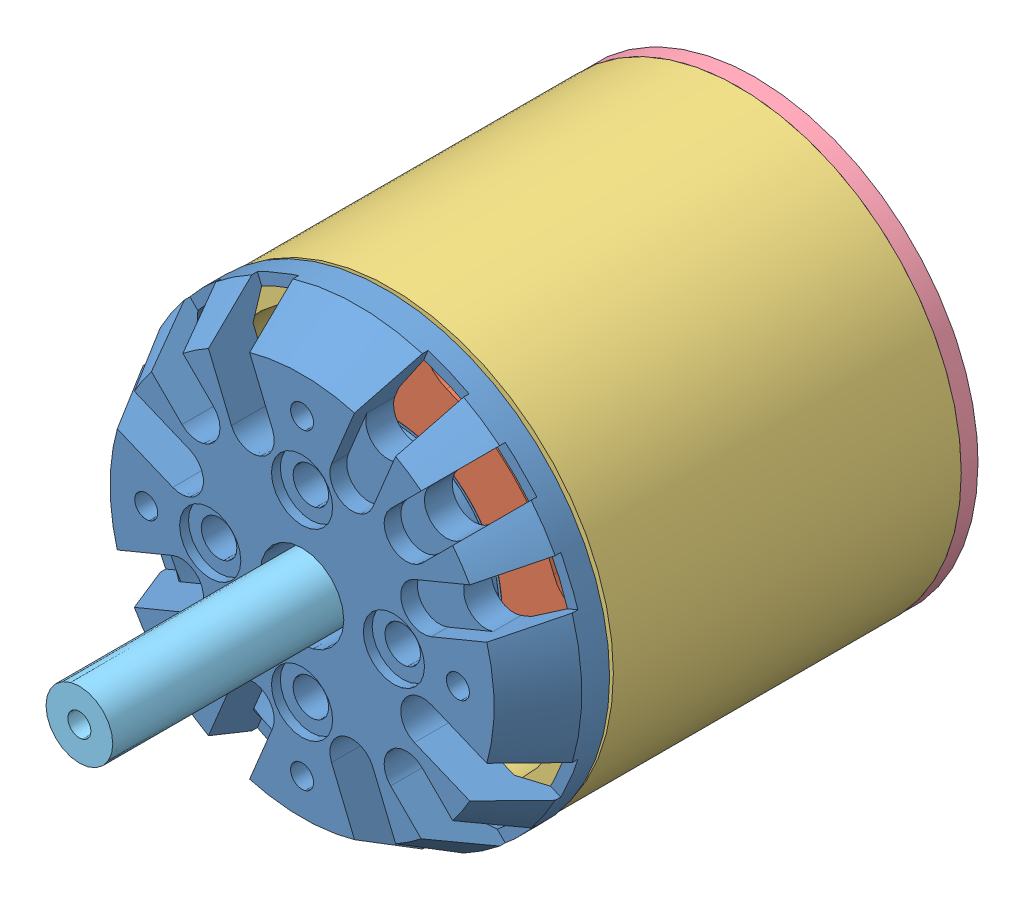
SolidWorks assembly turnigy_8085.sldasm, configuration Default (file format 7000). Lengths in mm.
Overall size (82.13 82.13 135.68).
5 component instances, 5 part files, 0 mates.
Components (placement in the parent):
- motor_mount-1: motor_mount.sldprt [Default] at origin size (80.5 80.5 22.9)
- can_other_end-1: can_other_end.sldprt [Default] at (0 0 -7.9) size (68 68 7)
- can-1: can.sldprt [Default] at (0 0 -63.4) size (80.05 80.05 62.5)
- endcap-1: endcap.sldprt [Default] at (0 0 -63.4) x (1 0 0) z (0 0 -1) size (82.13 82.13 17.76)
- motor_shaft-1: motor_shaft.sldprt [Default] at (0 0 -77.2) size (12 12 132.2)
